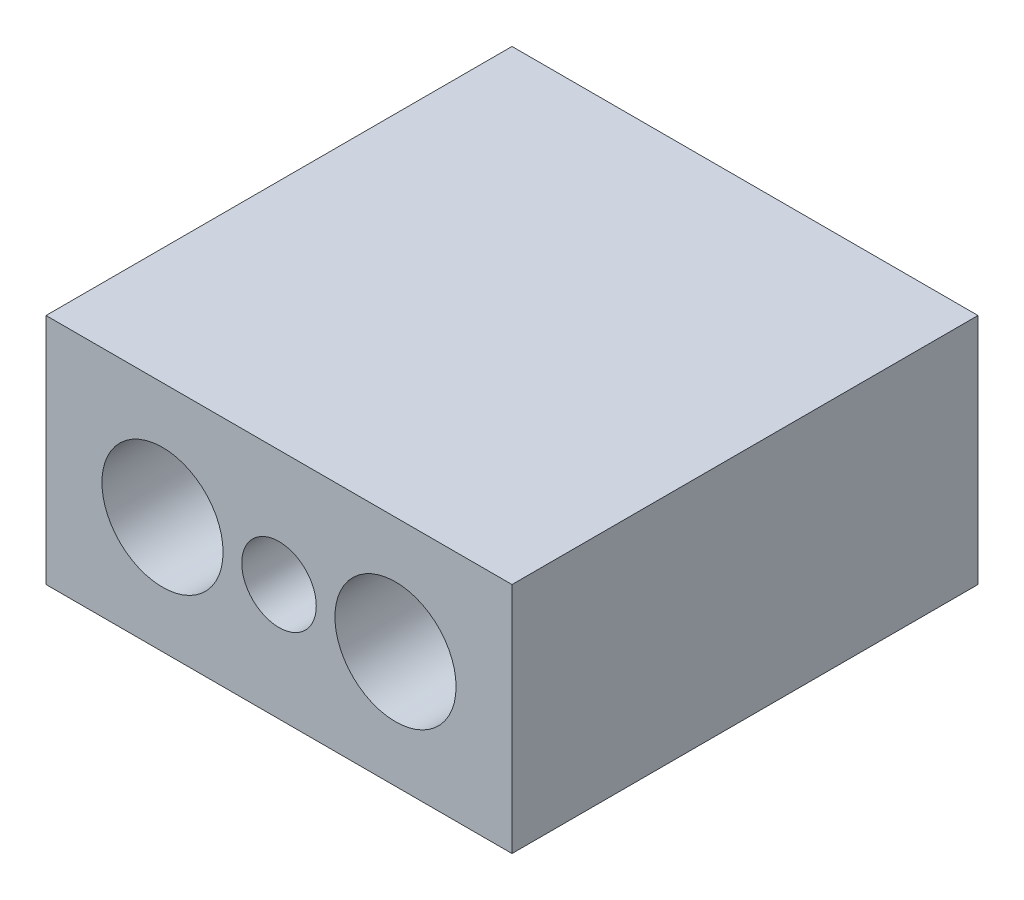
ISO-10303-21;
HEADER;
FILE_DESCRIPTION(('STEP AP214'),'2;1');
FILE_NAME('part.step','',(''),(''),'','','');
FILE_SCHEMA(('AUTOMOTIVE_DESIGN { 1 0 10303 214 1 1 1 1 }'));
ENDSEC;
DATA;
#1=APPLICATION_CONTEXT('core data for automotive mechanical design processes');
#2=APPLICATION_PROTOCOL_DEFINITION('international standard','automotive_design',2000,#1);
#3=PRODUCT_CONTEXT('',#1,'mechanical');
#4=PRODUCT('Part','Part','',(#3));
#5=PRODUCT_RELATED_PRODUCT_CATEGORY('part','',(#4));
#6=PRODUCT_DEFINITION_FORMATION('','',#4);
#7=PRODUCT_DEFINITION_CONTEXT('part definition',#1,'design');
#8=PRODUCT_DEFINITION('design','',#6,#7);
#9=PRODUCT_DEFINITION_SHAPE('','',#8);
#10=(LENGTH_UNIT() NAMED_UNIT(*) SI_UNIT(.MILLI.,.METRE.));
#11=(NAMED_UNIT(*) PLANE_ANGLE_UNIT() SI_UNIT($,.RADIAN.));
#12=(NAMED_UNIT(*) SI_UNIT($,.STERADIAN.) SOLID_ANGLE_UNIT());
#13=UNCERTAINTY_MEASURE_WITH_UNIT(LENGTH_MEASURE(1.E-05),#10,'distance_accuracy_value','');
#14=(GEOMETRIC_REPRESENTATION_CONTEXT(3) GLOBAL_UNCERTAINTY_ASSIGNED_CONTEXT((#13)) GLOBAL_UNIT_ASSIGNED_CONTEXT((#10,
#11,#12)) REPRESENTATION_CONTEXT('',''));
#15=CARTESIAN_POINT('',(0.,0.,0.));
#16=DIRECTION('',(0.,0.,1.));
#17=DIRECTION('',(1.,0.,0.));
#18=AXIS2_PLACEMENT_3D('',#15,#16,#17);
#19=CARTESIAN_POINT('',(-25.,25.,100.));
#20=DIRECTION('',(0.,0.,-1.));
#21=DIRECTION('',(-1.,0.,0.));
#22=AXIS2_PLACEMENT_3D('',#19,#20,#21);
#23=PLANE('',#22);
#24=CARTESIAN_POINT('',(25.,0.,100.));
#25=DIRECTION('',(0.,0.,1.));
#26=DIRECTION('',(1.,0.,0.));
#27=AXIS2_PLACEMENT_3D('',#24,#25,#26);
#28=CIRCLE('',#27,8.);
#29=CARTESIAN_POINT('',(33.,0.,100.));
#30=VERTEX_POINT('',#29);
#31=EDGE_CURVE('E147',#30,#30,#28,.T.);
#32=ORIENTED_EDGE('',*,*,#31,.F.);
#33=EDGE_LOOP('',(#32));
#34=FACE_BOUND('',#33,.T.);
#35=CARTESIAN_POINT('',(0.,0.,100.));
#36=DIRECTION('',(0.,0.,1.));
#37=DIRECTION('',(1.,0.,0.));
#38=AXIS2_PLACEMENT_3D('',#35,#36,#37);
#39=CIRCLE('',#38,13.);
#40=CARTESIAN_POINT('',(13.,0.,100.));
#41=VERTEX_POINT('',#40);
#42=EDGE_CURVE('E84',#41,#41,#39,.T.);
#43=ORIENTED_EDGE('',*,*,#42,.F.);
#44=EDGE_LOOP('',(#43));
#45=FACE_BOUND('',#44,.T.);
#46=DIRECTION('',(0.,1.,0.));
#47=VECTOR('',#46,1.);
#48=CARTESIAN_POINT('',(-25.,-25.,100.));
#49=LINE('',#48,#47);
#50=CARTESIAN_POINT('',(-25.,-25.,100.));
#51=VERTEX_POINT('',#50);
#52=CARTESIAN_POINT('',(-25.,25.,100.));
#53=VERTEX_POINT('',#52);
#54=EDGE_CURVE('E66',#51,#53,#49,.T.);
#55=ORIENTED_EDGE('',*,*,#54,.F.);
#56=DIRECTION('',(-1.,0.,0.));
#57=VECTOR('',#56,1.);
#58=CARTESIAN_POINT('',(75.,-25.,100.));
#59=LINE('',#58,#57);
#60=CARTESIAN_POINT('',(75.,-25.,100.));
#61=VERTEX_POINT('',#60);
#62=EDGE_CURVE('E48',#61,#51,#59,.T.);
#63=ORIENTED_EDGE('',*,*,#62,.F.);
#64=DIRECTION('',(0.,-1.,0.));
#65=VECTOR('',#64,1.);
#66=CARTESIAN_POINT('',(75.,25.,100.));
#67=LINE('',#66,#65);
#68=CARTESIAN_POINT('',(75.,25.,100.));
#69=VERTEX_POINT('',#68);
#70=EDGE_CURVE('E57',#69,#61,#67,.T.);
#71=ORIENTED_EDGE('',*,*,#70,.F.);
#72=DIRECTION('',(1.,0.,0.));
#73=VECTOR('',#72,1.);
#74=CARTESIAN_POINT('',(-25.,25.,100.));
#75=LINE('',#74,#73);
#76=EDGE_CURVE('E62',#53,#69,#75,.T.);
#77=ORIENTED_EDGE('',*,*,#76,.F.);
#78=EDGE_LOOP('',(#55,#63,#71,#77));
#79=FACE_BOUND('',#78,.T.);
#80=CARTESIAN_POINT('',(50.,0.,100.));
#81=DIRECTION('',(0.,0.,1.));
#82=DIRECTION('',(1.,0.,0.));
#83=AXIS2_PLACEMENT_3D('',#80,#81,#82);
#84=CIRCLE('',#83,13.);
#85=CARTESIAN_POINT('',(63.,0.,100.));
#86=VERTEX_POINT('',#85);
#87=EDGE_CURVE('E160',#86,#86,#84,.T.);
#88=ORIENTED_EDGE('',*,*,#87,.F.);
#89=EDGE_LOOP('',(#88));
#90=FACE_BOUND('',#89,.T.);
#91=ADVANCED_FACE('F14',(#34,#45,#79,#90),#23,.F.);
#92=CARTESIAN_POINT('',(-25.,25.,0.));
#93=DIRECTION('',(0.,0.,-1.));
#94=DIRECTION('',(-1.,0.,0.));
#95=AXIS2_PLACEMENT_3D('',#92,#93,#94);
#96=PLANE('',#95);
#97=CARTESIAN_POINT('',(0.,0.,0.));
#98=DIRECTION('',(0.,0.,1.));
#99=DIRECTION('',(1.,0.,0.));
#100=AXIS2_PLACEMENT_3D('',#97,#98,#99);
#101=CIRCLE('',#100,9.);
#102=CARTESIAN_POINT('',(9.,0.,0.));
#103=VERTEX_POINT('',#102);
#104=EDGE_CURVE('E163',#103,#103,#101,.T.);
#105=ORIENTED_EDGE('',*,*,#104,.T.);
#106=EDGE_LOOP('',(#105));
#107=FACE_BOUND('',#106,.T.);
#108=DIRECTION('',(0.,1.,0.));
#109=VECTOR('',#108,1.);
#110=CARTESIAN_POINT('',(-25.,-25.,0.));
#111=LINE('',#110,#109);
#112=CARTESIAN_POINT('',(-25.,-25.,0.));
#113=VERTEX_POINT('',#112);
#114=CARTESIAN_POINT('',(-25.,25.,0.));
#115=VERTEX_POINT('',#114);
#116=EDGE_CURVE('E67',#113,#115,#111,.T.);
#117=ORIENTED_EDGE('',*,*,#116,.T.);
#118=DIRECTION('',(1.,0.,0.));
#119=VECTOR('',#118,1.);
#120=CARTESIAN_POINT('',(-25.,25.,0.));
#121=LINE('',#120,#119);
#122=CARTESIAN_POINT('',(75.,25.,0.));
#123=VERTEX_POINT('',#122);
#124=EDGE_CURVE('E70',#115,#123,#121,.T.);
#125=ORIENTED_EDGE('',*,*,#124,.T.);
#126=DIRECTION('',(0.,-1.,0.));
#127=VECTOR('',#126,1.);
#128=CARTESIAN_POINT('',(75.,25.,0.));
#129=LINE('',#128,#127);
#130=CARTESIAN_POINT('',(75.,-25.,0.));
#131=VERTEX_POINT('',#130);
#132=EDGE_CURVE('E80',#123,#131,#129,.T.);
#133=ORIENTED_EDGE('',*,*,#132,.T.);
#134=DIRECTION('',(-1.,0.,0.));
#135=VECTOR('',#134,1.);
#136=CARTESIAN_POINT('',(75.,-25.,0.));
#137=LINE('',#136,#135);
#138=EDGE_CURVE('E51',#131,#113,#137,.T.);
#139=ORIENTED_EDGE('',*,*,#138,.T.);
#140=EDGE_LOOP('',(#117,#125,#133,#139));
#141=FACE_BOUND('',#140,.T.);
#142=CARTESIAN_POINT('',(50.,0.,0.));
#143=DIRECTION('',(0.,0.,1.));
#144=DIRECTION('',(1.,0.,0.));
#145=AXIS2_PLACEMENT_3D('',#142,#143,#144);
#146=CIRCLE('',#145,9.);
#147=CARTESIAN_POINT('',(59.,0.,0.));
#148=VERTEX_POINT('',#147);
#149=EDGE_CURVE('E146',#148,#148,#146,.T.);
#150=ORIENTED_EDGE('',*,*,#149,.T.);
#151=EDGE_LOOP('',(#150));
#152=FACE_BOUND('',#151,.T.);
#153=ADVANCED_FACE('F78',(#107,#141,#152),#96,.T.);
#154=CARTESIAN_POINT('',(-25.,-25.,100.));
#155=DIRECTION('',(-1.,0.,0.));
#156=DIRECTION('',(0.,0.,1.));
#157=AXIS2_PLACEMENT_3D('',#154,#155,#156);
#158=PLANE('',#157);
#159=DIRECTION('',(0.,0.,-1.));
#160=VECTOR('',#159,1.);
#161=CARTESIAN_POINT('',(-25.,-25.,100.));
#162=LINE('',#161,#160);
#163=EDGE_CURVE('E9',#51,#113,#162,.T.);
#164=ORIENTED_EDGE('',*,*,#163,.F.);
#165=ORIENTED_EDGE('',*,*,#54,.T.);
#166=DIRECTION('',(0.,0.,-1.));
#167=VECTOR('',#166,1.);
#168=CARTESIAN_POINT('',(-25.,25.,100.));
#169=LINE('',#168,#167);
#170=EDGE_CURVE('E30',#53,#115,#169,.T.);
#171=ORIENTED_EDGE('',*,*,#170,.T.);
#172=ORIENTED_EDGE('',*,*,#116,.F.);
#173=EDGE_LOOP('',(#164,#165,#171,#172));
#174=FACE_BOUND('',#173,.T.);
#175=ADVANCED_FACE('F88',(#174),#158,.T.);
#176=CARTESIAN_POINT('',(75.,-25.,100.));
#177=DIRECTION('',(0.,-1.,0.));
#178=DIRECTION('',(1.,0.,0.));
#179=AXIS2_PLACEMENT_3D('',#176,#177,#178);
#180=PLANE('',#179);
#181=DIRECTION('',(0.,0.,-1.));
#182=VECTOR('',#181,1.);
#183=CARTESIAN_POINT('',(75.,-25.,100.));
#184=LINE('',#183,#182);
#185=EDGE_CURVE('E23',#61,#131,#184,.T.);
#186=ORIENTED_EDGE('',*,*,#185,.F.);
#187=ORIENTED_EDGE('',*,*,#62,.T.);
#188=ORIENTED_EDGE('',*,*,#163,.T.);
#189=ORIENTED_EDGE('',*,*,#138,.F.);
#190=EDGE_LOOP('',(#186,#187,#188,#189));
#191=FACE_BOUND('',#190,.T.);
#192=ADVANCED_FACE('F16',(#191),#180,.T.);
#193=CARTESIAN_POINT('',(75.,25.,100.));
#194=DIRECTION('',(1.,0.,0.));
#195=DIRECTION('',(0.,1.,0.));
#196=AXIS2_PLACEMENT_3D('',#193,#194,#195);
#197=PLANE('',#196);
#198=DIRECTION('',(0.,0.,-1.));
#199=VECTOR('',#198,1.);
#200=CARTESIAN_POINT('',(75.,25.,100.));
#201=LINE('',#200,#199);
#202=EDGE_CURVE('E55',#69,#123,#201,.T.);
#203=ORIENTED_EDGE('',*,*,#202,.F.);
#204=ORIENTED_EDGE('',*,*,#70,.T.);
#205=ORIENTED_EDGE('',*,*,#185,.T.);
#206=ORIENTED_EDGE('',*,*,#132,.F.);
#207=EDGE_LOOP('',(#203,#204,#205,#206));
#208=FACE_BOUND('',#207,.T.);
#209=ADVANCED_FACE('F58',(#208),#197,.T.);
#210=CARTESIAN_POINT('',(-25.,25.,100.));
#211=DIRECTION('',(0.,1.,0.));
#212=DIRECTION('',(0.,0.,1.));
#213=AXIS2_PLACEMENT_3D('',#210,#211,#212);
#214=PLANE('',#213);
#215=ORIENTED_EDGE('',*,*,#76,.T.);
#216=ORIENTED_EDGE('',*,*,#202,.T.);
#217=ORIENTED_EDGE('',*,*,#124,.F.);
#218=ORIENTED_EDGE('',*,*,#170,.F.);
#219=EDGE_LOOP('',(#215,#216,#217,#218));
#220=FACE_BOUND('',#219,.T.);
#221=ADVANCED_FACE('F76',(#220),#214,.T.);
#222=CARTESIAN_POINT('',(0.,0.,100.));
#223=DIRECTION('',(0.,0.,1.));
#224=DIRECTION('',(1.,0.,0.));
#225=AXIS2_PLACEMENT_3D('',#222,#223,#224);
#226=CYLINDRICAL_SURFACE('',#225,13.);
#227=ORIENTED_EDGE('',*,*,#42,.T.);
#228=EDGE_LOOP('',(#227));
#229=FACE_BOUND('',#228,.T.);
#230=CARTESIAN_POINT('',(0.,0.,46.));
#231=DIRECTION('',(0.,0.,1.));
#232=DIRECTION('',(1.,0.,0.));
#233=AXIS2_PLACEMENT_3D('',#230,#231,#232);
#234=CIRCLE('',#233,13.);
#235=CARTESIAN_POINT('',(13.,0.,46.));
#236=VERTEX_POINT('',#235);
#237=EDGE_CURVE('E169',#236,#236,#234,.T.);
#238=ORIENTED_EDGE('',*,*,#237,.F.);
#239=EDGE_LOOP('',(#238));
#240=FACE_BOUND('',#239,.T.);
#241=ADVANCED_FACE('F110',(#229,#240),#226,.F.);
#242=CARTESIAN_POINT('',(9.,0.,46.));
#243=DIRECTION('',(0.,0.,1.));
#244=DIRECTION('',(1.,0.,0.));
#245=AXIS2_PLACEMENT_3D('',#242,#243,#244);
#246=PLANE('',#245);
#247=ORIENTED_EDGE('',*,*,#237,.T.);
#248=EDGE_LOOP('',(#247));
#249=FACE_BOUND('',#248,.T.);
#250=CARTESIAN_POINT('',(0.,0.,46.));
#251=DIRECTION('',(0.,0.,1.));
#252=DIRECTION('',(1.,0.,0.));
#253=AXIS2_PLACEMENT_3D('',#250,#251,#252);
#254=CIRCLE('',#253,9.);
#255=CARTESIAN_POINT('',(9.,0.,46.));
#256=VERTEX_POINT('',#255);
#257=EDGE_CURVE('E166',#256,#256,#254,.T.);
#258=ORIENTED_EDGE('',*,*,#257,.F.);
#259=EDGE_LOOP('',(#258));
#260=FACE_BOUND('',#259,.T.);
#261=ADVANCED_FACE('F113',(#249,#260),#246,.T.);
#262=CARTESIAN_POINT('',(0.,0.,100.));
#263=DIRECTION('',(0.,0.,1.));
#264=DIRECTION('',(1.,0.,0.));
#265=AXIS2_PLACEMENT_3D('',#262,#263,#264);
#266=CYLINDRICAL_SURFACE('',#265,9.);
#267=ORIENTED_EDGE('',*,*,#257,.T.);
#268=EDGE_LOOP('',(#267));
#269=FACE_BOUND('',#268,.T.);
#270=ORIENTED_EDGE('',*,*,#104,.F.);
#271=EDGE_LOOP('',(#270));
#272=FACE_BOUND('',#271,.T.);
#273=ADVANCED_FACE('F117',(#269,#272),#266,.F.);
#274=CARTESIAN_POINT('',(50.,0.,100.));
#275=DIRECTION('',(0.,0.,1.));
#276=DIRECTION('',(1.,0.,0.));
#277=AXIS2_PLACEMENT_3D('',#274,#275,#276);
#278=CYLINDRICAL_SURFACE('',#277,13.);
#279=ORIENTED_EDGE('',*,*,#87,.T.);
#280=EDGE_LOOP('',(#279));
#281=FACE_BOUND('',#280,.T.);
#282=CARTESIAN_POINT('',(50.,0.,46.));
#283=DIRECTION('',(0.,0.,1.));
#284=DIRECTION('',(1.,0.,0.));
#285=AXIS2_PLACEMENT_3D('',#282,#283,#284);
#286=CIRCLE('',#285,13.);
#287=CARTESIAN_POINT('',(63.,0.,46.));
#288=VERTEX_POINT('',#287);
#289=EDGE_CURVE('E157',#288,#288,#286,.T.);
#290=ORIENTED_EDGE('',*,*,#289,.F.);
#291=EDGE_LOOP('',(#290));
#292=FACE_BOUND('',#291,.T.);
#293=ADVANCED_FACE('F121',(#281,#292),#278,.F.);
#294=CARTESIAN_POINT('',(59.,0.,46.));
#295=DIRECTION('',(0.,0.,1.));
#296=DIRECTION('',(1.,0.,0.));
#297=AXIS2_PLACEMENT_3D('',#294,#295,#296);
#298=PLANE('',#297);
#299=ORIENTED_EDGE('',*,*,#289,.T.);
#300=EDGE_LOOP('',(#299));
#301=FACE_BOUND('',#300,.T.);
#302=CARTESIAN_POINT('',(50.,0.,46.));
#303=DIRECTION('',(0.,0.,1.));
#304=DIRECTION('',(1.,0.,0.));
#305=AXIS2_PLACEMENT_3D('',#302,#303,#304);
#306=CIRCLE('',#305,9.);
#307=CARTESIAN_POINT('',(59.,0.,46.));
#308=VERTEX_POINT('',#307);
#309=EDGE_CURVE('E150',#308,#308,#306,.T.);
#310=ORIENTED_EDGE('',*,*,#309,.F.);
#311=EDGE_LOOP('',(#310));
#312=FACE_BOUND('',#311,.T.);
#313=ADVANCED_FACE('F125',(#301,#312),#298,.T.);
#314=CARTESIAN_POINT('',(50.,0.,100.));
#315=DIRECTION('',(0.,0.,1.));
#316=DIRECTION('',(1.,0.,0.));
#317=AXIS2_PLACEMENT_3D('',#314,#315,#316);
#318=CYLINDRICAL_SURFACE('',#317,9.);
#319=ORIENTED_EDGE('',*,*,#309,.T.);
#320=EDGE_LOOP('',(#319));
#321=FACE_BOUND('',#320,.T.);
#322=ORIENTED_EDGE('',*,*,#149,.F.);
#323=EDGE_LOOP('',(#322));
#324=FACE_BOUND('',#323,.T.);
#325=ADVANCED_FACE('F129',(#321,#324),#318,.F.);
#326=CARTESIAN_POINT('',(25.,0.,65.));
#327=DIRECTION('',(0.,0.,1.));
#328=DIRECTION('',(1.,0.,0.));
#329=AXIS2_PLACEMENT_3D('',#326,#327,#328);
#330=CYLINDRICAL_SURFACE('',#329,8.);
#331=CARTESIAN_POINT('',(25.,0.,65.));
#332=DIRECTION('',(0.,0.,1.));
#333=DIRECTION('',(1.,0.,0.));
#334=AXIS2_PLACEMENT_3D('',#331,#332,#333);
#335=CIRCLE('',#334,8.);
#336=CARTESIAN_POINT('',(33.,0.,65.));
#337=VERTEX_POINT('',#336);
#338=EDGE_CURVE('E145',#337,#337,#335,.T.);
#339=ORIENTED_EDGE('',*,*,#338,.F.);
#340=EDGE_LOOP('',(#339));
#341=FACE_BOUND('',#340,.T.);
#342=ORIENTED_EDGE('',*,*,#31,.T.);
#343=EDGE_LOOP('',(#342));
#344=FACE_BOUND('',#343,.T.);
#345=ADVANCED_FACE('F133',(#341,#344),#330,.F.);
#346=CARTESIAN_POINT('',(25.,0.,65.));
#347=DIRECTION('',(0.,0.,1.));
#348=DIRECTION('',(1.,0.,0.));
#349=AXIS2_PLACEMENT_3D('',#346,#347,#348);
#350=PLANE('',#349);
#351=ORIENTED_EDGE('',*,*,#338,.T.);
#352=EDGE_LOOP('',(#351));
#353=FACE_BOUND('',#352,.T.);
#354=ADVANCED_FACE('F135',(#353),#350,.T.);
#355=CLOSED_SHELL('',(#91,#153,#175,#192,#209,#221,#241,#261,#273,#293,#313,#325,#345,#354));
#356=MANIFOLD_SOLID_BREP('B1',#355);
#357=ADVANCED_BREP_SHAPE_REPRESENTATION('',(#18,#356),#14);
#358=SHAPE_DEFINITION_REPRESENTATION(#9,#357);
ENDSEC;
END-ISO-10303-21;
